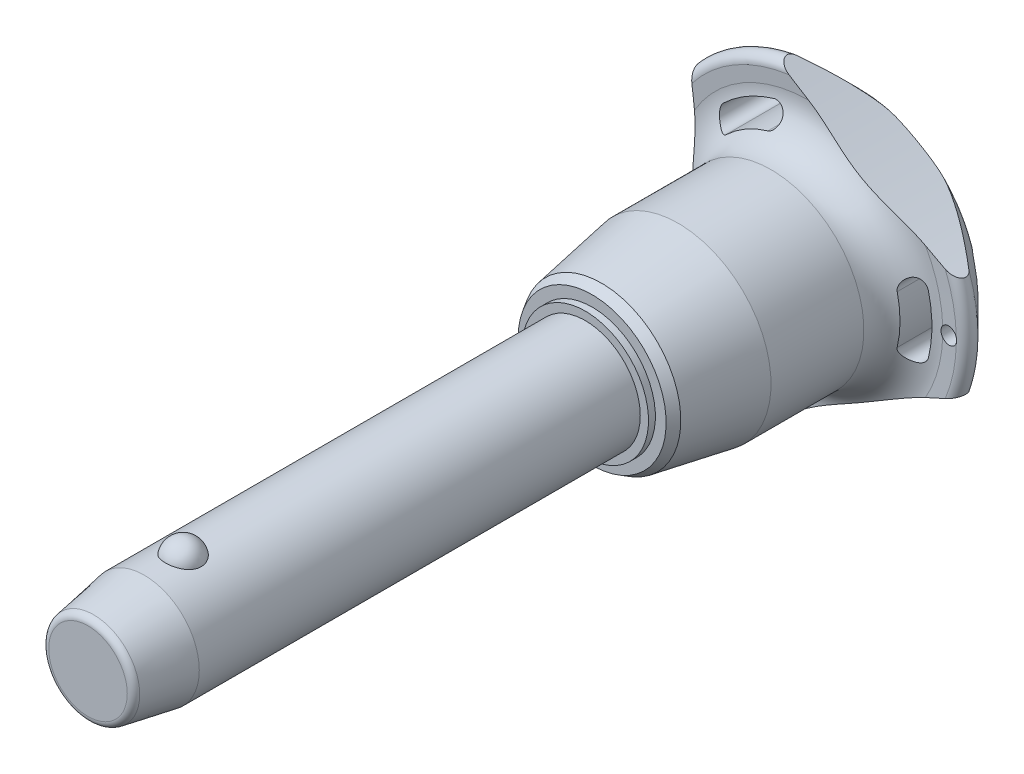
from build123d import *

# Parameters (mm, degrees)
SKETCH1_R           = 10
BOSS_EXTRUDE1_DEPTH = 70
SKETCH2_R           = 8.75
BOSS_EXTRUDE2_DEPTH = 50.7
BOSS_EXTRUDE3_START = 20.5
SKETCH1_2_R         = 10
BOSS_EXTRUDE3_DEPTH = 20.5
CHAMFER1_SIZE       = 10.25
CHAMFER1_SIZE2      = 1.807351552
FILLET1_R           = 1.25
SKETCH6_R           = 176.92625
CUT_EXTRUDE1_DEPTH  = 128.274554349
CIRPATTERN1_COUNT   = 3
SKETCH7_R           = 1.5
CUT_EXTRUDE2_DEPTH  = 128.154892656


with BuildPart() as part:
    # Sketch1 → Boss-Extrude1 (new body)
    with BuildSketch(Plane.XY):
        Circle(SKETCH1_R)
    extrude(amount=-BOSS_EXTRUDE1_DEPTH)

    # Sketch2 → Boss-Extrude2 (add)
    with BuildSketch(Plane(origin=(0, 0, -70), x_dir=(-1, 0, 0), z_dir=(0, 0, -1))):
        with Locations(Location((0, 0, 0), (0, 0, 180))):
            Circle(SKETCH2_R)
    extrude(amount=BOSS_EXTRUDE2_DEPTH)

    # Sketch3 → Revolve1 (revolve)
    with BuildSketch(Plane(origin=(0, 0, 0), x_dir=(0, 0, -1), z_dir=(1, 0, 0))):
        with BuildLine():
            Line((-3.201562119, 12.5), (-3.201562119, 5.9))
            ThreePointArc((-3.201562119, 5.9), (0.098437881, 9.2), (-3.201562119, 12.5))
        make_face()
        with BuildLine():
            Line((-3.201562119, -5.9), (-3.201562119, -12.5))
            ThreePointArc((-3.201562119, -12.5), (0.098437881, -9.2), (-3.201562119, -5.9))
        make_face()
    revolve(axis=Axis((0, -5.9, 3.201562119), (0, 1, 0)))

    # Sketch1_2 → Boss-Extrude3 (add)
    with BuildSketch(Plane.XY.offset(BOSS_EXTRUDE3_START)):
        Circle(SKETCH1_2_R)
    extrude(amount=-BOSS_EXTRUDE3_DEPTH)

    # Chamfer1
    chamfer1_edges = [part.edges().sort_by_distance(p)[0] for p in [
        (-10, 0, 20.5),
    ]]
    chamfer1_side = [part.faces().sort_by_distance(p)[0] for p in [
        (-10, 0, -24.75),
    ]]
    chamfer(chamfer1_edges, length=CHAMFER1_SIZE, length2=CHAMFER1_SIZE2, reference=chamfer1_side[0])

    # Fillet1
    fillet1_edges = [part.edges().sort_by_distance(p)[0] for p in [
        (-8.192648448, 0, 20.5),
        (-8.75, 0, -120.7),
    ]]
    fillet(fillet1_edges, radius=FILLET1_R)

    # Sketch4 → Revolve2 (revolve)
    with BuildSketch(Plane(origin=(0, 0, 0), x_dir=(0, 0, -1), z_dir=(1, 0, 0)), mode=Mode.PRIVATE) as revolve2_sk:
        Polygon((70, 0), (70, 11.504815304), (71.25, 11.504815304), (71.25, 13.461079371), (72.944174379, 14.439211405), (86.9, 16.9), (103.8, 16.9), (103.8, 0), align=None)
    revolve(revolve2_sk.sketch.rotate(Axis((0, 0, -103.8), (0, 0, 1)), 90), axis=Axis((0, 0, -103.8), (0, 0, 1)))

    # Sketch5 → Revolve3 (revolve)
    with BuildSketch(Plane(origin=(0, 0, 0), x_dir=(0, 0, -1), z_dir=(1, 0, 0)), mode=Mode.PRIVATE) as revolve3_sk:
        with BuildLine():
            Line((110.790129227, 24.271609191), (110.652256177, 26.865060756))
            ThreePointArc((110.652256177, 26.865060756), (111.598671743, 28.411427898), (113.38137085, 28.08137085))
            Line((113.38137085, 28.08137085), (119.763226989, 21.69951471))
            ThreePointArc((119.763226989, 21.69951471), (120.7, 19.381044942), (119.683055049, 17.096604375))
            ThreePointArc((119.683055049, 17.096604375), (114.18864484, 9.321268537), (112.25, 0))
            Line((112.25, 0), (103.8, 0))
            Line((103.8, 0), (103.8, 16.9))
            ThreePointArc((103.8, 16.9), (108.879432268, 19.083427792), (110.790129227, 24.271609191))
        make_face()
    revolve(revolve3_sk.sketch.rotate(Axis((0, 0, -112.25), (0, 0, 1)), 90), axis=Axis((0, 0, -112.25), (0, 0, 1)))

    # Sketch6 → Cut-Extrude1 (cut, through all)
    with BuildSketch(Plane.XY):
        with Locations((-197.42625, 0)):
            Circle(SKETCH6_R)
        with BuildLine():
            ThreePointArc((21.802992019, -5.260839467), (22.428706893, 0), (21.802992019, 5.260839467))
            ThreePointArc((21.802992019, 5.260839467), (19.579234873, 6.620060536), (18.220013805, 4.39630339))
            ThreePointArc((18.220013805, 4.39630339), (18.742902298, 0), (18.220013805, -4.39630339))
            ThreePointArc((18.220013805, -4.39630339), (19.579234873, -6.620060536), (21.802992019, -5.260839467))
        make_face()
    cut_extrude1 = extrude(amount=-CUT_EXTRUDE1_DEPTH, mode=Mode.SUBTRACT)

    # CirPattern1: Cut-Extrude1 ×3 about axis
    cirpattern1_axis = Axis((0, 0, 0), (0, 0, 1))
    for i in range(1, CIRPATTERN1_COUNT):
        add(cut_extrude1.rotate(cirpattern1_axis, i * 360 / CIRPATTERN1_COUNT), mode=Mode.SUBTRACT)

    # Sketch7 → Cut-Extrude2 (cut, through all)
    with BuildSketch(Plane.XY):
        with Locations(Location((25.428706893, 0, 0), (0, 0, 17.230769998))):
            Circle(SKETCH7_R)
    extrude(amount=-CUT_EXTRUDE2_DEPTH, mode=Mode.SUBTRACT)


solid = part.part
